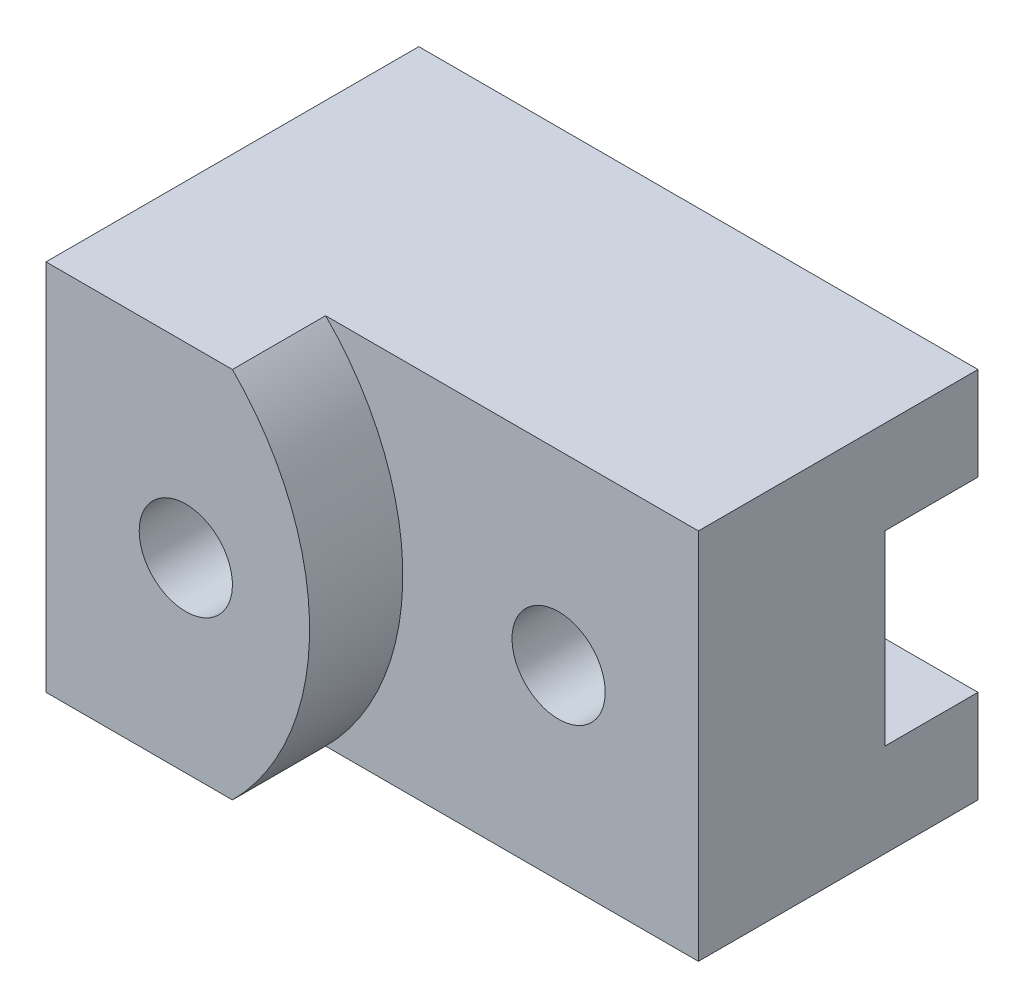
ISO-10303-21;
HEADER;
FILE_DESCRIPTION(('STEP AP214'),'2;1');
FILE_NAME('part.step','',(''),(''),'','','');
FILE_SCHEMA(('AUTOMOTIVE_DESIGN { 1 0 10303 214 1 1 1 1 }'));
ENDSEC;
DATA;
#1=APPLICATION_CONTEXT('core data for automotive mechanical design processes');
#2=APPLICATION_PROTOCOL_DEFINITION('international standard','automotive_design',2000,#1);
#3=PRODUCT_CONTEXT('',#1,'mechanical');
#4=PRODUCT('Part','Part','',(#3));
#5=PRODUCT_RELATED_PRODUCT_CATEGORY('part','',(#4));
#6=PRODUCT_DEFINITION_FORMATION('','',#4);
#7=PRODUCT_DEFINITION_CONTEXT('part definition',#1,'design');
#8=PRODUCT_DEFINITION('design','',#6,#7);
#9=PRODUCT_DEFINITION_SHAPE('','',#8);
#10=(LENGTH_UNIT() NAMED_UNIT(*) SI_UNIT(.MILLI.,.METRE.));
#11=(NAMED_UNIT(*) PLANE_ANGLE_UNIT() SI_UNIT($,.RADIAN.));
#12=(NAMED_UNIT(*) SI_UNIT($,.STERADIAN.) SOLID_ANGLE_UNIT());
#13=UNCERTAINTY_MEASURE_WITH_UNIT(LENGTH_MEASURE(1.E-05),#10,'distance_accuracy_value','');
#14=(GEOMETRIC_REPRESENTATION_CONTEXT(3) GLOBAL_UNCERTAINTY_ASSIGNED_CONTEXT((#13)) GLOBAL_UNIT_ASSIGNED_CONTEXT((#10,
#11,#12)) REPRESENTATION_CONTEXT('',''));
#15=CARTESIAN_POINT('',(0.,0.,0.));
#16=DIRECTION('',(0.,0.,1.));
#17=DIRECTION('',(1.,0.,0.));
#18=AXIS2_PLACEMENT_3D('',#15,#16,#17);
#19=CARTESIAN_POINT('',(-152.4,25.4,0.));
#20=DIRECTION('',(0.,1.,0.));
#21=DIRECTION('',(0.,0.,1.));
#22=AXIS2_PLACEMENT_3D('',#19,#20,#21);
#23=PLANE('',#22);
#24=DIRECTION('',(0.,0.,1.));
#25=VECTOR('',#24,1.);
#26=CARTESIAN_POINT('',(0.,25.4,0.));
#27=LINE('',#26,#25);
#28=CARTESIAN_POINT('',(0.,25.4,-76.2));
#29=VERTEX_POINT('',#28);
#30=CARTESIAN_POINT('',(0.,25.4,-50.8));
#31=VERTEX_POINT('',#30);
#32=EDGE_CURVE('E169',#29,#31,#27,.T.);
#33=ORIENTED_EDGE('',*,*,#32,.F.);
#34=DIRECTION('',(1.,0.,0.));
#35=VECTOR('',#34,1.);
#36=CARTESIAN_POINT('',(-152.4,25.4,-76.2));
#37=LINE('',#36,#35);
#38=CARTESIAN_POINT('',(-152.4,25.4,-76.2));
#39=VERTEX_POINT('',#38);
#40=EDGE_CURVE('E11',#39,#29,#37,.T.);
#41=ORIENTED_EDGE('',*,*,#40,.F.);
#42=DIRECTION('',(0.,0.,1.));
#43=VECTOR('',#42,1.);
#44=CARTESIAN_POINT('',(-152.4,25.4,0.));
#45=LINE('',#44,#43);
#46=CARTESIAN_POINT('',(-152.4,25.4,-50.8));
#47=VERTEX_POINT('',#46);
#48=EDGE_CURVE('E213',#39,#47,#45,.T.);
#49=ORIENTED_EDGE('',*,*,#48,.T.);
#50=DIRECTION('',(1.,0.,0.));
#51=VECTOR('',#50,1.);
#52=CARTESIAN_POINT('',(-152.4,25.4,-50.8));
#53=LINE('',#52,#51);
#54=EDGE_CURVE('E50',#47,#31,#53,.T.);
#55=ORIENTED_EDGE('',*,*,#54,.T.);
#56=EDGE_LOOP('',(#33,#41,#49,#55));
#57=FACE_BOUND('',#56,.T.);
#58=ADVANCED_FACE('F47',(#57),#23,.T.);
#59=CARTESIAN_POINT('',(-152.4,0.,-76.2));
#60=DIRECTION('',(0.,0.,-1.));
#61=DIRECTION('',(-1.,0.,0.));
#62=AXIS2_PLACEMENT_3D('',#59,#60,#61);
#63=PLANE('',#62);
#64=DIRECTION('',(0.,1.,0.));
#65=VECTOR('',#64,1.);
#66=CARTESIAN_POINT('',(0.,0.,-76.2));
#67=LINE('',#66,#65);
#68=CARTESIAN_POINT('',(0.,0.,-76.2));
#69=VERTEX_POINT('',#68);
#70=EDGE_CURVE('E185',#69,#29,#67,.T.);
#71=ORIENTED_EDGE('',*,*,#70,.F.);
#72=DIRECTION('',(1.,0.,0.));
#73=VECTOR('',#72,1.);
#74=CARTESIAN_POINT('',(-152.4,0.,-76.2));
#75=LINE('',#74,#73);
#76=CARTESIAN_POINT('',(-152.4,0.,-76.2));
#77=VERTEX_POINT('',#76);
#78=EDGE_CURVE('E56',#77,#69,#75,.T.);
#79=ORIENTED_EDGE('',*,*,#78,.F.);
#80=DIRECTION('',(0.,1.,0.));
#81=VECTOR('',#80,1.);
#82=CARTESIAN_POINT('',(-152.4,0.,-76.2));
#83=LINE('',#82,#81);
#84=EDGE_CURVE('E155',#77,#39,#83,.T.);
#85=ORIENTED_EDGE('',*,*,#84,.T.);
#86=ORIENTED_EDGE('',*,*,#40,.T.);
#87=EDGE_LOOP('',(#71,#79,#85,#86));
#88=FACE_BOUND('',#87,.T.);
#89=ADVANCED_FACE('F289',(#88),#63,.T.);
#90=CARTESIAN_POINT('',(-152.4,0.,0.));
#91=DIRECTION('',(0.,-1.,0.));
#92=DIRECTION('',(0.,0.,-1.));
#93=AXIS2_PLACEMENT_3D('',#90,#91,#92);
#94=PLANE('',#93);
#95=DIRECTION('',(0.,0.,-1.));
#96=VECTOR('',#95,1.);
#97=CARTESIAN_POINT('',(0.,0.,0.));
#98=LINE('',#97,#96);
#99=CARTESIAN_POINT('',(0.,0.,0.));
#100=VERTEX_POINT('',#99);
#101=EDGE_CURVE('E192',#100,#69,#98,.T.);
#102=ORIENTED_EDGE('',*,*,#101,.F.);
#103=DIRECTION('',(1.,0.,0.));
#104=VECTOR('',#103,1.);
#105=CARTESIAN_POINT('',(-152.4,0.,0.));
#106=LINE('',#105,#104);
#107=CARTESIAN_POINT('',(-101.6,0.,0.));
#108=VERTEX_POINT('',#107);
#109=EDGE_CURVE('E198',#108,#100,#106,.T.);
#110=ORIENTED_EDGE('',*,*,#109,.F.);
#111=DIRECTION('',(0.,0.,-1.));
#112=VECTOR('',#111,1.);
#113=CARTESIAN_POINT('',(-101.6,0.,25.4));
#114=LINE('',#113,#112);
#115=CARTESIAN_POINT('',(-101.6,0.,25.4));
#116=VERTEX_POINT('',#115);
#117=EDGE_CURVE('E64',#116,#108,#114,.T.);
#118=ORIENTED_EDGE('',*,*,#117,.F.);
#119=DIRECTION('',(1.,0.,0.));
#120=VECTOR('',#119,1.);
#121=CARTESIAN_POINT('',(-152.4,0.,25.4));
#122=LINE('',#121,#120);
#123=CARTESIAN_POINT('',(-152.4,0.,25.4));
#124=VERTEX_POINT('',#123);
#125=EDGE_CURVE('E248',#124,#116,#122,.T.);
#126=ORIENTED_EDGE('',*,*,#125,.F.);
#127=DIRECTION('',(0.,0.,-1.));
#128=VECTOR('',#127,1.);
#129=CARTESIAN_POINT('',(-152.4,0.,0.));
#130=LINE('',#129,#128);
#131=EDGE_CURVE('E136',#124,#77,#130,.T.);
#132=ORIENTED_EDGE('',*,*,#131,.T.);
#133=ORIENTED_EDGE('',*,*,#78,.T.);
#134=EDGE_LOOP('',(#102,#110,#118,#126,#132,#133));
#135=FACE_BOUND('',#134,.T.);
#136=ADVANCED_FACE('F293',(#135),#94,.T.);
#137=CARTESIAN_POINT('',(-152.4,0.,0.));
#138=DIRECTION('',(0.,0.,-1.));
#139=DIRECTION('',(-1.,0.,0.));
#140=AXIS2_PLACEMENT_3D('',#137,#138,#139);
#141=PLANE('',#140);
#142=CARTESIAN_POINT('',(-38.1,50.8,0.));
#143=DIRECTION('',(0.,0.,-1.));
#144=DIRECTION('',(0.,1.,0.));
#145=AXIS2_PLACEMENT_3D('',#142,#143,#144);
#146=CIRCLE('',#145,12.7);
#147=CARTESIAN_POINT('',(-38.1,63.5,0.));
#148=VERTEX_POINT('',#147);
#149=EDGE_CURVE('E174',#148,#148,#146,.T.);
#150=ORIENTED_EDGE('',*,*,#149,.T.);
#151=EDGE_LOOP('',(#150));
#152=FACE_BOUND('',#151,.T.);
#153=DIRECTION('',(1.,0.,0.));
#154=VECTOR('',#153,1.);
#155=CARTESIAN_POINT('',(-152.4,101.6,0.));
#156=LINE('',#155,#154);
#157=CARTESIAN_POINT('',(-101.6,101.6,0.));
#158=VERTEX_POINT('',#157);
#159=CARTESIAN_POINT('',(0.,101.6,0.));
#160=VERTEX_POINT('',#159);
#161=EDGE_CURVE('E147',#158,#160,#156,.T.);
#162=ORIENTED_EDGE('',*,*,#161,.F.);
#163=CARTESIAN_POINT('',(-152.4,50.8,0.));
#164=DIRECTION('',(0.,0.,-1.));
#165=DIRECTION('',(-1.,0.,0.));
#166=AXIS2_PLACEMENT_3D('',#163,#164,#165);
#167=CIRCLE('',#166,71.8420489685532);
#168=EDGE_CURVE('E241',#158,#108,#167,.T.);
#169=ORIENTED_EDGE('',*,*,#168,.T.);
#170=ORIENTED_EDGE('',*,*,#109,.T.);
#171=DIRECTION('',(0.,1.,0.));
#172=VECTOR('',#171,1.);
#173=CARTESIAN_POINT('',(0.,0.,0.));
#174=LINE('',#173,#172);
#175=EDGE_CURVE('E188',#100,#160,#174,.T.);
#176=ORIENTED_EDGE('',*,*,#175,.T.);
#177=EDGE_LOOP('',(#162,#169,#170,#176));
#178=FACE_BOUND('',#177,.T.);
#179=ADVANCED_FACE('F298',(#152,#178),#141,.F.);
#180=CARTESIAN_POINT('',(-152.4,101.6,0.));
#181=DIRECTION('',(0.,-1.,0.));
#182=DIRECTION('',(0.,0.,-1.));
#183=AXIS2_PLACEMENT_3D('',#180,#181,#182);
#184=PLANE('',#183);
#185=DIRECTION('',(0.,0.,-1.));
#186=VECTOR('',#185,1.);
#187=CARTESIAN_POINT('',(0.,101.6,0.));
#188=LINE('',#187,#186);
#189=CARTESIAN_POINT('',(0.,101.6,-76.2));
#190=VERTEX_POINT('',#189);
#191=EDGE_CURVE('E142',#160,#190,#188,.T.);
#192=ORIENTED_EDGE('',*,*,#191,.T.);
#193=DIRECTION('',(1.,0.,0.));
#194=VECTOR('',#193,1.);
#195=CARTESIAN_POINT('',(-152.4,101.6,-76.2));
#196=LINE('',#195,#194);
#197=CARTESIAN_POINT('',(-152.4,101.6,-76.2));
#198=VERTEX_POINT('',#197);
#199=EDGE_CURVE('E139',#198,#190,#196,.T.);
#200=ORIENTED_EDGE('',*,*,#199,.F.);
#201=DIRECTION('',(0.,0.,-1.));
#202=VECTOR('',#201,1.);
#203=CARTESIAN_POINT('',(-152.4,101.6,0.));
#204=LINE('',#203,#202);
#205=CARTESIAN_POINT('',(-152.4,101.6,25.4));
#206=VERTEX_POINT('',#205);
#207=EDGE_CURVE('E124',#206,#198,#204,.T.);
#208=ORIENTED_EDGE('',*,*,#207,.F.);
#209=DIRECTION('',(1.,0.,0.));
#210=VECTOR('',#209,1.);
#211=CARTESIAN_POINT('',(-152.4,101.6,25.4));
#212=LINE('',#211,#210);
#213=CARTESIAN_POINT('',(-101.6,101.6,25.4));
#214=VERTEX_POINT('',#213);
#215=EDGE_CURVE('E244',#206,#214,#212,.T.);
#216=ORIENTED_EDGE('',*,*,#215,.T.);
#217=DIRECTION('',(0.,0.,-1.));
#218=VECTOR('',#217,1.);
#219=CARTESIAN_POINT('',(-101.6,101.6,25.4));
#220=LINE('',#219,#218);
#221=EDGE_CURVE('E235',#214,#158,#220,.T.);
#222=ORIENTED_EDGE('',*,*,#221,.T.);
#223=ORIENTED_EDGE('',*,*,#161,.T.);
#224=EDGE_LOOP('',(#192,#200,#208,#216,#222,#223));
#225=FACE_BOUND('',#224,.T.);
#226=ADVANCED_FACE('F140',(#225),#184,.F.);
#227=CARTESIAN_POINT('',(0.,76.2,-76.2));
#228=VERTEX_POINT('',#227);
#229=EDGE_CURVE('E182',#228,#190,#67,.T.);
#230=ORIENTED_EDGE('',*,*,#229,.F.);
#231=DIRECTION('',(1.,0.,0.));
#232=VECTOR('',#231,1.);
#233=CARTESIAN_POINT('',(-152.4,76.2,-76.2));
#234=LINE('',#233,#232);
#235=CARTESIAN_POINT('',(-152.4,76.2,-76.2));
#236=VERTEX_POINT('',#235);
#237=EDGE_CURVE('E148',#236,#228,#234,.T.);
#238=ORIENTED_EDGE('',*,*,#237,.F.);
#239=EDGE_CURVE('E128',#236,#198,#83,.T.);
#240=ORIENTED_EDGE('',*,*,#239,.T.);
#241=ORIENTED_EDGE('',*,*,#199,.T.);
#242=EDGE_LOOP('',(#230,#238,#240,#241));
#243=FACE_BOUND('',#242,.T.);
#244=ADVANCED_FACE('F150',(#243),#63,.T.);
#245=CARTESIAN_POINT('',(-152.4,76.2,0.));
#246=DIRECTION('',(0.,1.,0.));
#247=DIRECTION('',(0.,0.,1.));
#248=AXIS2_PLACEMENT_3D('',#245,#246,#247);
#249=PLANE('',#248);
#250=DIRECTION('',(0.,0.,1.));
#251=VECTOR('',#250,1.);
#252=CARTESIAN_POINT('',(0.,76.2,0.));
#253=LINE('',#252,#251);
#254=CARTESIAN_POINT('',(0.,76.2,-50.8));
#255=VERTEX_POINT('',#254);
#256=EDGE_CURVE('E178',#228,#255,#253,.T.);
#257=ORIENTED_EDGE('',*,*,#256,.T.);
#258=DIRECTION('',(1.,0.,0.));
#259=VECTOR('',#258,1.);
#260=CARTESIAN_POINT('',(-152.4,76.2,-50.8));
#261=LINE('',#260,#259);
#262=CARTESIAN_POINT('',(-152.4,76.2,-50.8));
#263=VERTEX_POINT('',#262);
#264=EDGE_CURVE('E163',#263,#255,#261,.T.);
#265=ORIENTED_EDGE('',*,*,#264,.F.);
#266=DIRECTION('',(0.,0.,1.));
#267=VECTOR('',#266,1.);
#268=CARTESIAN_POINT('',(-152.4,76.2,0.));
#269=LINE('',#268,#267);
#270=EDGE_CURVE('E153',#236,#263,#269,.T.);
#271=ORIENTED_EDGE('',*,*,#270,.F.);
#272=ORIENTED_EDGE('',*,*,#237,.T.);
#273=EDGE_LOOP('',(#257,#265,#271,#272));
#274=FACE_BOUND('',#273,.T.);
#275=ADVANCED_FACE('F209',(#274),#249,.F.);
#276=CARTESIAN_POINT('',(-152.4,0.,-50.8));
#277=DIRECTION('',(0.,0.,-1.));
#278=DIRECTION('',(0.,1.,0.));
#279=AXIS2_PLACEMENT_3D('',#276,#277,#278);
#280=PLANE('',#279);
#281=CARTESIAN_POINT('',(-114.3,50.8000000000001,-50.8));
#282=DIRECTION('',(0.,0.,-1.));
#283=DIRECTION('',(0.,1.,0.));
#284=AXIS2_PLACEMENT_3D('',#281,#282,#283);
#285=CIRCLE('',#284,12.7);
#286=CARTESIAN_POINT('',(-114.3,63.5000000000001,-50.8));
#287=VERTEX_POINT('',#286);
#288=EDGE_CURVE('E260',#287,#287,#285,.T.);
#289=ORIENTED_EDGE('',*,*,#288,.F.);
#290=EDGE_LOOP('',(#289));
#291=FACE_BOUND('',#290,.T.);
#292=CARTESIAN_POINT('',(-38.1,50.8,-50.8));
#293=DIRECTION('',(0.,0.,-1.));
#294=DIRECTION('',(0.,1.,0.));
#295=AXIS2_PLACEMENT_3D('',#292,#293,#294);
#296=CIRCLE('',#295,19.05);
#297=CARTESIAN_POINT('',(-38.1,69.85,-50.8));
#298=VERTEX_POINT('',#297);
#299=EDGE_CURVE('E231',#298,#298,#296,.T.);
#300=ORIENTED_EDGE('',*,*,#299,.F.);
#301=EDGE_LOOP('',(#300));
#302=FACE_BOUND('',#301,.T.);
#303=DIRECTION('',(0.,1.,0.));
#304=VECTOR('',#303,1.);
#305=CARTESIAN_POINT('',(0.,0.,-50.8));
#306=LINE('',#305,#304);
#307=EDGE_CURVE('E173',#31,#255,#306,.T.);
#308=ORIENTED_EDGE('',*,*,#307,.F.);
#309=ORIENTED_EDGE('',*,*,#54,.F.);
#310=DIRECTION('',(0.,1.,0.));
#311=VECTOR('',#310,1.);
#312=CARTESIAN_POINT('',(-152.4,0.,-50.8));
#313=LINE('',#312,#311);
#314=EDGE_CURVE('E157',#47,#263,#313,.T.);
#315=ORIENTED_EDGE('',*,*,#314,.T.);
#316=ORIENTED_EDGE('',*,*,#264,.T.);
#317=EDGE_LOOP('',(#308,#309,#315,#316));
#318=FACE_BOUND('',#317,.T.);
#319=ADVANCED_FACE('F206',(#291,#302,#318),#280,.T.);
#320=CARTESIAN_POINT('',(-152.4,0.,0.));
#321=DIRECTION('',(1.,0.,0.));
#322=DIRECTION('',(0.,0.,-1.));
#323=AXIS2_PLACEMENT_3D('',#320,#321,#322);
#324=PLANE('',#323);
#325=ORIENTED_EDGE('',*,*,#48,.F.);
#326=ORIENTED_EDGE('',*,*,#84,.F.);
#327=ORIENTED_EDGE('',*,*,#131,.F.);
#328=DIRECTION('',(0.,-1.,0.));
#329=VECTOR('',#328,1.);
#330=CARTESIAN_POINT('',(-152.4,101.6,25.4));
#331=LINE('',#330,#329);
#332=EDGE_CURVE('E131',#206,#124,#331,.T.);
#333=ORIENTED_EDGE('',*,*,#332,.F.);
#334=ORIENTED_EDGE('',*,*,#207,.T.);
#335=ORIENTED_EDGE('',*,*,#239,.F.);
#336=ORIENTED_EDGE('',*,*,#270,.T.);
#337=ORIENTED_EDGE('',*,*,#314,.F.);
#338=EDGE_LOOP('',(#325,#326,#327,#333,#334,#335,#336,#337));
#339=FACE_BOUND('',#338,.T.);
#340=ADVANCED_FACE('F126',(#339),#324,.F.);
#341=CARTESIAN_POINT('',(0.,0.,0.));
#342=DIRECTION('',(1.,0.,0.));
#343=DIRECTION('',(0.,0.,-1.));
#344=AXIS2_PLACEMENT_3D('',#341,#342,#343);
#345=PLANE('',#344);
#346=ORIENTED_EDGE('',*,*,#32,.T.);
#347=ORIENTED_EDGE('',*,*,#307,.T.);
#348=ORIENTED_EDGE('',*,*,#256,.F.);
#349=ORIENTED_EDGE('',*,*,#229,.T.);
#350=ORIENTED_EDGE('',*,*,#191,.F.);
#351=ORIENTED_EDGE('',*,*,#175,.F.);
#352=ORIENTED_EDGE('',*,*,#101,.T.);
#353=ORIENTED_EDGE('',*,*,#70,.T.);
#354=EDGE_LOOP('',(#346,#347,#348,#349,#350,#351,#352,#353));
#355=FACE_BOUND('',#354,.T.);
#356=ADVANCED_FACE('F211',(#355),#345,.T.);
#357=CARTESIAN_POINT('',(-38.1,50.8,-50.8));
#358=DIRECTION('',(0.,0.,-1.));
#359=DIRECTION('',(0.,1.,0.));
#360=AXIS2_PLACEMENT_3D('',#357,#358,#359);
#361=CYLINDRICAL_SURFACE('',#360,12.7);
#362=ORIENTED_EDGE('',*,*,#149,.F.);
#363=EDGE_LOOP('',(#362));
#364=FACE_BOUND('',#363,.T.);
#365=CARTESIAN_POINT('',(-38.1,50.8,-45.72));
#366=DIRECTION('',(0.,0.,-1.));
#367=DIRECTION('',(0.,1.,0.));
#368=AXIS2_PLACEMENT_3D('',#365,#366,#367);
#369=CIRCLE('',#368,12.7);
#370=CARTESIAN_POINT('',(-38.1,63.5,-45.72));
#371=VERTEX_POINT('',#370);
#372=EDGE_CURVE('E223',#371,#371,#369,.T.);
#373=ORIENTED_EDGE('',*,*,#372,.T.);
#374=EDGE_LOOP('',(#373));
#375=FACE_BOUND('',#374,.T.);
#376=ADVANCED_FACE('F284',(#364,#375),#361,.F.);
#377=CARTESIAN_POINT('',(-25.4,50.8,-45.72));
#378=DIRECTION('',(0.,0.,1.));
#379=DIRECTION('',(0.,-1.,0.));
#380=AXIS2_PLACEMENT_3D('',#377,#378,#379);
#381=PLANE('',#380);
#382=ORIENTED_EDGE('',*,*,#372,.F.);
#383=EDGE_LOOP('',(#382));
#384=FACE_BOUND('',#383,.T.);
#385=CARTESIAN_POINT('',(-38.1,50.8,-45.72));
#386=DIRECTION('',(0.,0.,-1.));
#387=DIRECTION('',(0.,1.,0.));
#388=AXIS2_PLACEMENT_3D('',#385,#386,#387);
#389=CIRCLE('',#388,19.05);
#390=CARTESIAN_POINT('',(-38.1,69.85,-45.72));
#391=VERTEX_POINT('',#390);
#392=EDGE_CURVE('E227',#391,#391,#389,.T.);
#393=ORIENTED_EDGE('',*,*,#392,.T.);
#394=EDGE_LOOP('',(#393));
#395=FACE_BOUND('',#394,.T.);
#396=ADVANCED_FACE('F274',(#384,#395),#381,.F.);
#397=CARTESIAN_POINT('',(-38.1,50.8,-50.8));
#398=DIRECTION('',(0.,0.,-1.));
#399=DIRECTION('',(0.,1.,0.));
#400=AXIS2_PLACEMENT_3D('',#397,#398,#399);
#401=CYLINDRICAL_SURFACE('',#400,19.05);
#402=ORIENTED_EDGE('',*,*,#392,.F.);
#403=EDGE_LOOP('',(#402));
#404=FACE_BOUND('',#403,.T.);
#405=ORIENTED_EDGE('',*,*,#299,.T.);
#406=EDGE_LOOP('',(#405));
#407=FACE_BOUND('',#406,.T.);
#408=ADVANCED_FACE('F271',(#404,#407),#401,.F.);
#409=CARTESIAN_POINT('',(-152.4,50.8,25.4));
#410=DIRECTION('',(0.,0.,-1.));
#411=DIRECTION('',(-1.,0.,0.));
#412=AXIS2_PLACEMENT_3D('',#409,#410,#411);
#413=CYLINDRICAL_SURFACE('',#412,71.8420489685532);
#414=ORIENTED_EDGE('',*,*,#168,.F.);
#415=ORIENTED_EDGE('',*,*,#221,.F.);
#416=CARTESIAN_POINT('',(-152.4,50.8,25.4));
#417=DIRECTION('',(0.,0.,-1.));
#418=DIRECTION('',(-1.,0.,0.));
#419=AXIS2_PLACEMENT_3D('',#416,#417,#418);
#420=CIRCLE('',#419,71.8420489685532);
#421=EDGE_CURVE('E252',#214,#116,#420,.T.);
#422=ORIENTED_EDGE('',*,*,#421,.T.);
#423=ORIENTED_EDGE('',*,*,#117,.T.);
#424=EDGE_LOOP('',(#414,#415,#422,#423));
#425=FACE_BOUND('',#424,.T.);
#426=ADVANCED_FACE('F273',(#425),#413,.T.);
#427=CARTESIAN_POINT('',(-152.4,50.8,25.4));
#428=DIRECTION('',(0.,0.,-1.));
#429=DIRECTION('',(-1.,0.,0.));
#430=AXIS2_PLACEMENT_3D('',#427,#428,#429);
#431=PLANE('',#430);
#432=CARTESIAN_POINT('',(-114.3,50.8000000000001,25.4));
#433=DIRECTION('',(0.,0.,-1.));
#434=DIRECTION('',(-1.,0.,0.));
#435=AXIS2_PLACEMENT_3D('',#432,#433,#434);
#436=CIRCLE('',#435,12.7);
#437=CARTESIAN_POINT('',(-127.,50.8000000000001,25.4));
#438=VERTEX_POINT('',#437);
#439=EDGE_CURVE('E245',#438,#438,#436,.F.);
#440=ORIENTED_EDGE('',*,*,#439,.F.);
#441=EDGE_LOOP('',(#440));
#442=FACE_BOUND('',#441,.T.);
#443=ORIENTED_EDGE('',*,*,#215,.F.);
#444=ORIENTED_EDGE('',*,*,#332,.T.);
#445=ORIENTED_EDGE('',*,*,#125,.T.);
#446=ORIENTED_EDGE('',*,*,#421,.F.);
#447=EDGE_LOOP('',(#443,#444,#445,#446));
#448=FACE_BOUND('',#447,.T.);
#449=ADVANCED_FACE('F282',(#442,#448),#431,.F.);
#450=CARTESIAN_POINT('',(-114.3,50.8,61.3210244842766));
#451=DIRECTION('',(0.,0.,-1.));
#452=DIRECTION('',(0.,1.,0.));
#453=AXIS2_PLACEMENT_3D('',#450,#451,#452);
#454=CYLINDRICAL_SURFACE('',#453,12.7);
#455=ORIENTED_EDGE('',*,*,#439,.T.);
#456=EDGE_LOOP('',(#455));
#457=FACE_BOUND('',#456,.T.);
#458=ORIENTED_EDGE('',*,*,#288,.T.);
#459=EDGE_LOOP('',(#458));
#460=FACE_BOUND('',#459,.T.);
#461=ADVANCED_FACE('F265',(#457,#460),#454,.F.);
#462=CLOSED_SHELL('',(#58,#89,#136,#179,#226,#244,#275,#319,#340,#356,#376,#396,#408,#426,#449,#461));
#463=MANIFOLD_SOLID_BREP('B2',#462);
#464=ADVANCED_BREP_SHAPE_REPRESENTATION('',(#18,#463),#14);
#465=SHAPE_DEFINITION_REPRESENTATION(#9,#464);
ENDSEC;
END-ISO-10303-21;
